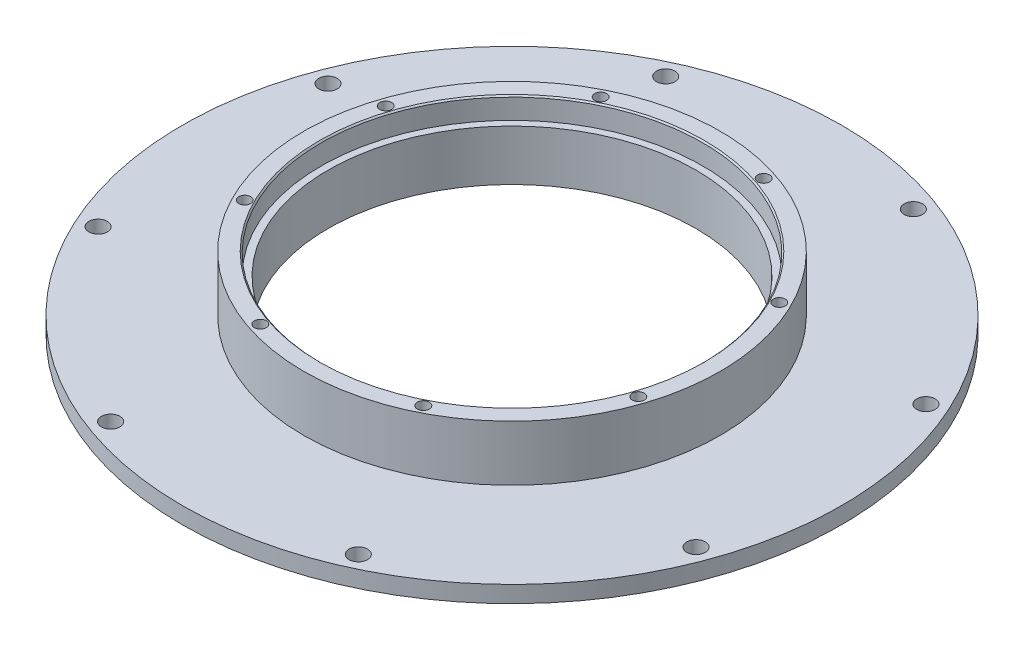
from build123d import *

# Parameters (mm, degrees)
SKETCH1_R               = 120.65
BOSS_EXTRUDE1_DEPTH     = 30.861
SKETCH2_R               = 67.31
CUT_EXTRUDE2_DEPTH      = 174.393328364
SKETCH4_R               = 69.8627
CUT_EXTRUDE3_DEPTH      = 7.874
SKETCH5_OUTSIDE_W       = 311.828
SKETCH5_OUTSIDE_H       = 311.828
SKETCH5_OUTSIDE_R       = 76.2
CUT_EXTRUDE4_DEPTH      = 20.32
F_1_4_CLEARANCE_HOLE1_D = 6.7564
CIRPATTERN1_COUNT       = 8
CIRPATTERN2_COUNT       = 8
CHAMFER2_SIZE           = 0.508
SKETCH12_OUTSIDE_W      = 311.828
SKETCH12_OUTSIDE_H      = 311.828
SKETCH12_OUTSIDE_R      = 109.22
CUT_EXTRUDE6_DEPTH      = 4.445
CHAMFER3_SIZE           = 1.27
SKETCH13_R              = 105.664
CUT_EXTRUDE7_DEPTH      = 4.445


with BuildPart() as part:
    # Sketch1 → Boss-Extrude1 (new body)
    with BuildSketch(Plane(origin=(0, 0, 0), x_dir=(1, 0, 0), z_dir=(0, 1, 0))):
        with Locations(Location((0, 0, 0), (0, 0, 270))):
            Circle(SKETCH1_R)
    extrude(amount=BOSS_EXTRUDE1_DEPTH)

    # Sketch2 → Cut-Extrude2 (cut, through all)
    with BuildSketch(Plane(origin=(0, 30.861, 0), x_dir=(1, 0, 0), z_dir=(0, 1, 0))):
        with Locations(Location((0, 0, 0), (0, 0, 270))):
            Circle(SKETCH2_R)
    extrude(amount=-CUT_EXTRUDE2_DEPTH, mode=Mode.SUBTRACT)

    # Sketch4 → Cut-Extrude3 (cut)
    with BuildSketch(Plane(origin=(0, 30.861, 0), x_dir=(1, 0, 0), z_dir=(0, 1, 0))):
        with Locations(Location((0, 0, 0), (0, 0, 270))):
            Circle(SKETCH4_R)
    extrude(amount=-CUT_EXTRUDE3_DEPTH, mode=Mode.SUBTRACT)

    # Sketch5 outside → Cut-Extrude4 (cut)
    with BuildSketch(Plane(origin=(0, 30.861, 0), x_dir=(1, 0, 0), z_dir=(0, 1, 0))):
        Rectangle(SKETCH5_OUTSIDE_W, SKETCH5_OUTSIDE_H)
        with Locations(Location((0, 0, 0), (0, 0, 270))):
            Circle(SKETCH5_OUTSIDE_R, mode=Mode.SUBTRACT)
    extrude(amount=-CUT_EXTRUDE4_DEPTH, mode=Mode.SUBTRACT)

    # 1_4 Clearance Hole1 (through all)
    with Locations(Plane(origin=(0, 10.541, 0), x_dir=(1, 0, 0), z_dir=(0, 1, 0))):
        with Locations((-39.78935448, -107.150815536)):
            f_1_4_clearance_hole1 = Hole(F_1_4_CLEARANCE_HOLE1_D / 2)

    # CirPattern1: 1_4 Clearance Hole1 ×8 about axis
    cirpattern1_axis = Axis((0, 0, 0), (0, 1, 0))
    for i in range(1, CIRPATTERN1_COUNT):
        add(f_1_4_clearance_hole1.rotate(cirpattern1_axis, i * 360 / CIRPATTERN1_COUNT), mode=Mode.SUBTRACT)

    # Sketch9 → Tapped Hole for _8-32 Helicoil1 (revolve, cut)
    with BuildSketch(Plane(origin=(-65.157083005, 30.861, 32.690563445), x_dir=(0, 0, 1), z_dir=(1, 0, 0))):
        Polygon((0, 0), (0, 16.839550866), (2.1971, 15.5194), (2.1971, 0), align=None)
    tapped_hole_for_8_32_helicoil1 = revolve(axis=Axis((-65.157083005, 37.211, 32.690563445), (0, -1, 0)), mode=Mode.SUBTRACT)

    # CirPattern2: Tapped Hole for _8-32 Helicoil1 ×8 about axis
    cirpattern2_axis = Axis((0, 0, 0), (0, 1, 0))
    for i in range(1, CIRPATTERN2_COUNT):
        add(tapped_hole_for_8_32_helicoil1.rotate(cirpattern2_axis, i * 360 / CIRPATTERN2_COUNT), mode=Mode.SUBTRACT)

    # Chamfer2
    chamfer2_edges = [part.edges().sort_by_distance(p)[0] for p in [
        (0, 30.861, -69.8627),
    ]]
    chamfer(chamfer2_edges, length=CHAMFER2_SIZE)

    # Sketch12 outside → Cut-Extrude6 (cut)
    with BuildSketch(Plane.XZ):
        Rectangle(SKETCH12_OUTSIDE_W, SKETCH12_OUTSIDE_H)
        with Locations(Location((0, 0, 0), (0, 0, 270))):
            Circle(SKETCH12_OUTSIDE_R, mode=Mode.SUBTRACT)
    extrude(amount=-CUT_EXTRUDE6_DEPTH, mode=Mode.SUBTRACT)

    # Chamfer3
    chamfer3_edges = [part.edges().sort_by_distance(p)[0] for p in [
        (0, 0, 109.22),
    ]]
    chamfer(chamfer3_edges, length=CHAMFER3_SIZE)

    # Sketch13 → Cut-Extrude7 (cut)
    with BuildSketch(Plane.XZ):
        with Locations(Location((0, 0, 0), (0, 0, 270))):
            Circle(SKETCH13_R)
    extrude(amount=-CUT_EXTRUDE7_DEPTH, mode=Mode.SUBTRACT)


solid = part.part
